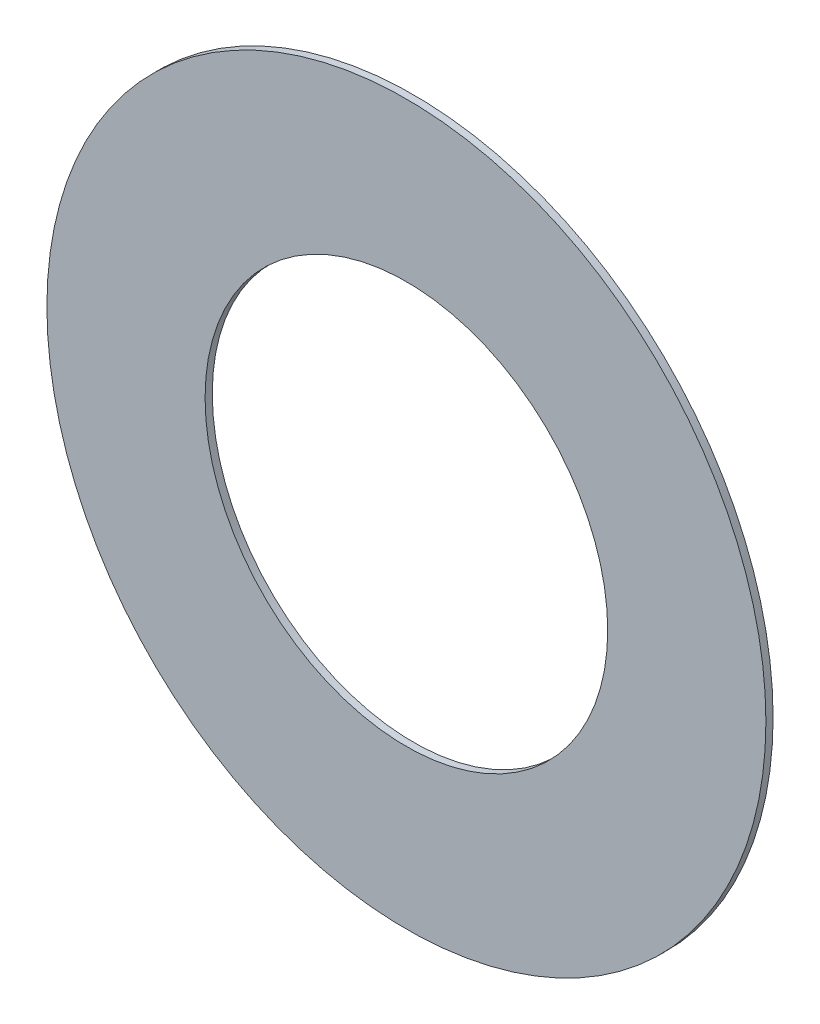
from build123d import *

# Parameters (mm, degrees)
ESQUISSE1_R      = 37.5
ESQUISSE1_R_2    = 21
EXTRUSION1_DEPTH = 0.75


with BuildPart() as part:
    # Esquisse1 → Extrusion1 (new body)
    with BuildSketch(Plane.XY):
        Circle(ESQUISSE1_R)
        Circle(ESQUISSE1_R_2, mode=Mode.SUBTRACT)
    extrude(amount=EXTRUSION1_DEPTH)


solid = part.part
